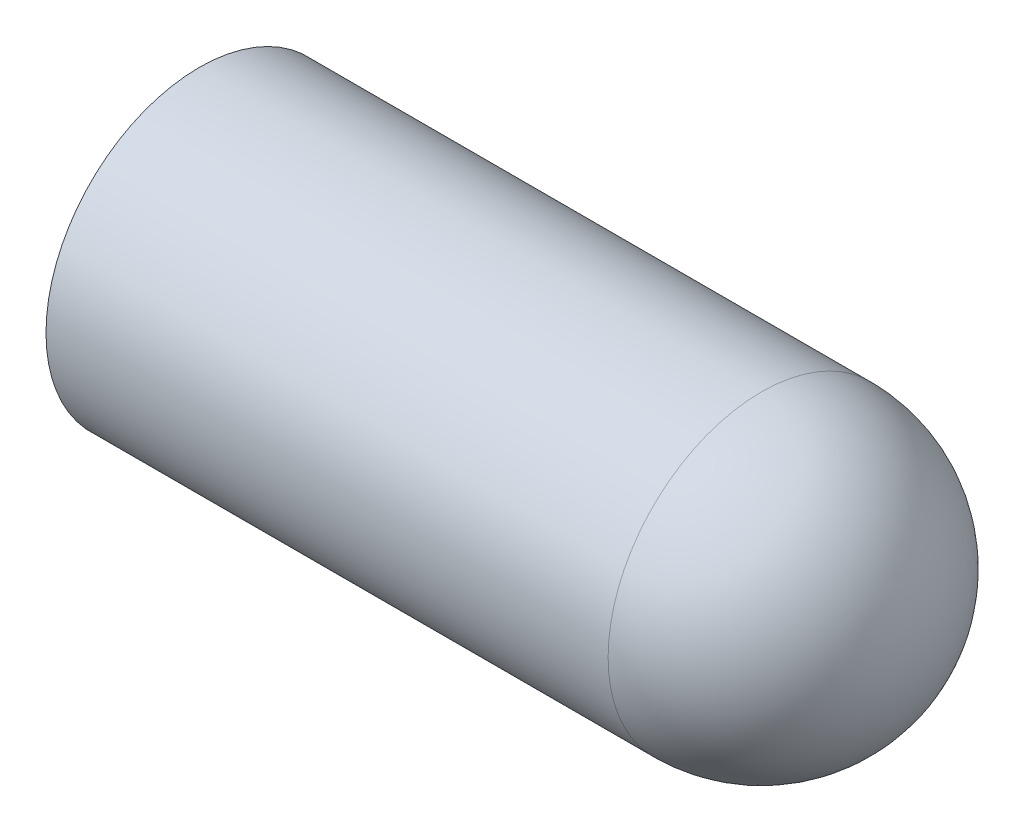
ISO-10303-21;
HEADER;
FILE_DESCRIPTION(('STEP AP214'),'2;1');
FILE_NAME('part.step','',(''),(''),'','','');
FILE_SCHEMA(('AUTOMOTIVE_DESIGN { 1 0 10303 214 1 1 1 1 }'));
ENDSEC;
DATA;
#1=APPLICATION_CONTEXT('core data for automotive mechanical design processes');
#2=APPLICATION_PROTOCOL_DEFINITION('international standard','automotive_design',2000,#1);
#3=PRODUCT_CONTEXT('',#1,'mechanical');
#4=PRODUCT('Part','Part','',(#3));
#5=PRODUCT_RELATED_PRODUCT_CATEGORY('part','',(#4));
#6=PRODUCT_DEFINITION_FORMATION('','',#4);
#7=PRODUCT_DEFINITION_CONTEXT('part definition',#1,'design');
#8=PRODUCT_DEFINITION('design','',#6,#7);
#9=PRODUCT_DEFINITION_SHAPE('','',#8);
#10=(LENGTH_UNIT() NAMED_UNIT(*) SI_UNIT(.MILLI.,.METRE.));
#11=(NAMED_UNIT(*) PLANE_ANGLE_UNIT() SI_UNIT($,.RADIAN.));
#12=(NAMED_UNIT(*) SI_UNIT($,.STERADIAN.) SOLID_ANGLE_UNIT());
#13=UNCERTAINTY_MEASURE_WITH_UNIT(LENGTH_MEASURE(1.E-05),#10,'distance_accuracy_value','');
#14=(GEOMETRIC_REPRESENTATION_CONTEXT(3) GLOBAL_UNCERTAINTY_ASSIGNED_CONTEXT((#13)) GLOBAL_UNIT_ASSIGNED_CONTEXT((#10,
#11,#12)) REPRESENTATION_CONTEXT('',''));
#15=CARTESIAN_POINT('',(0.,0.,0.));
#16=DIRECTION('',(0.,0.,1.));
#17=DIRECTION('',(1.,0.,0.));
#18=AXIS2_PLACEMENT_3D('',#15,#16,#17);
#19=CARTESIAN_POINT('',(-28.855,-150.245,0.));
#20=DIRECTION('',(-1.,0.,0.));
#21=DIRECTION('',(0.,-1.,0.));
#22=AXIS2_PLACEMENT_3D('',#19,#20,#21);
#23=CYLINDRICAL_SURFACE('',#22,1.4925);
#24=CARTESIAN_POINT('',(-30.3475,-150.245,0.));
#25=DIRECTION('',(-1.,0.,0.));
#26=DIRECTION('',(0.,0.,1.));
#27=AXIS2_PLACEMENT_3D('',#24,#25,#26);
#28=CIRCLE('',#27,1.4925);
#29=CARTESIAN_POINT('',(-30.3475,-150.245,1.4925));
#30=VERTEX_POINT('',#29);
#31=EDGE_CURVE('E10',#30,#30,#28,.T.);
#32=ORIENTED_EDGE('',*,*,#31,.T.);
#33=EDGE_LOOP('',(#32));
#34=FACE_BOUND('',#33,.T.);
#35=CARTESIAN_POINT('',(-35.82,-150.245,0.));
#36=DIRECTION('',(-1.,0.,0.));
#37=DIRECTION('',(0.,-1.,0.));
#38=AXIS2_PLACEMENT_3D('',#35,#36,#37);
#39=CIRCLE('',#38,1.4925);
#40=CARTESIAN_POINT('',(-35.82,-151.7375,0.));
#41=VERTEX_POINT('',#40);
#42=EDGE_CURVE('E21',#41,#41,#39,.T.);
#43=ORIENTED_EDGE('',*,*,#42,.F.);
#44=EDGE_LOOP('',(#43));
#45=FACE_BOUND('',#44,.T.);
#46=ADVANCED_FACE('F14',(#34,#45),#23,.T.);
#47=CARTESIAN_POINT('',(-35.82,-150.245,0.));
#48=DIRECTION('',(-1.,0.,0.));
#49=DIRECTION('',(0.,-1.,0.));
#50=AXIS2_PLACEMENT_3D('',#47,#48,#49);
#51=PLANE('',#50);
#52=ORIENTED_EDGE('',*,*,#42,.T.);
#53=EDGE_LOOP('',(#52));
#54=FACE_BOUND('',#53,.T.);
#55=ADVANCED_FACE('F46',(#54),#51,.T.);
#56=CARTESIAN_POINT('',(-30.3475,-150.245,0.));
#57=DIRECTION('',(0.,0.,1.));
#58=DIRECTION('',(1.,0.,0.));
#59=AXIS2_PLACEMENT_3D('',#56,#57,#58);
#60=SPHERICAL_SURFACE('',#59,1.4925);
#61=CARTESIAN_POINT('',(-30.3475,-150.245,0.));
#62=DIRECTION('',(-1.,0.,0.));
#63=DIRECTION('',(0.,0.,1.));
#64=AXIS2_PLACEMENT_3D('',#61,#62,#63);
#65=SPHERICAL_SURFACE('',#64,1.4925);
#66=ORIENTED_EDGE('',*,*,#31,.F.);
#67=EDGE_LOOP('',(#66));
#68=FACE_BOUND('',#67,.T.);
#69=ADVANCED_FACE('F54',(#68),#65,.T.);
#70=CLOSED_SHELL('',(#46,#55,#69));
#71=MANIFOLD_SOLID_BREP('B1',#70);
#72=ADVANCED_BREP_SHAPE_REPRESENTATION('',(#18,#71),#14);
#73=SHAPE_DEFINITION_REPRESENTATION(#9,#72);
ENDSEC;
END-ISO-10303-21;
